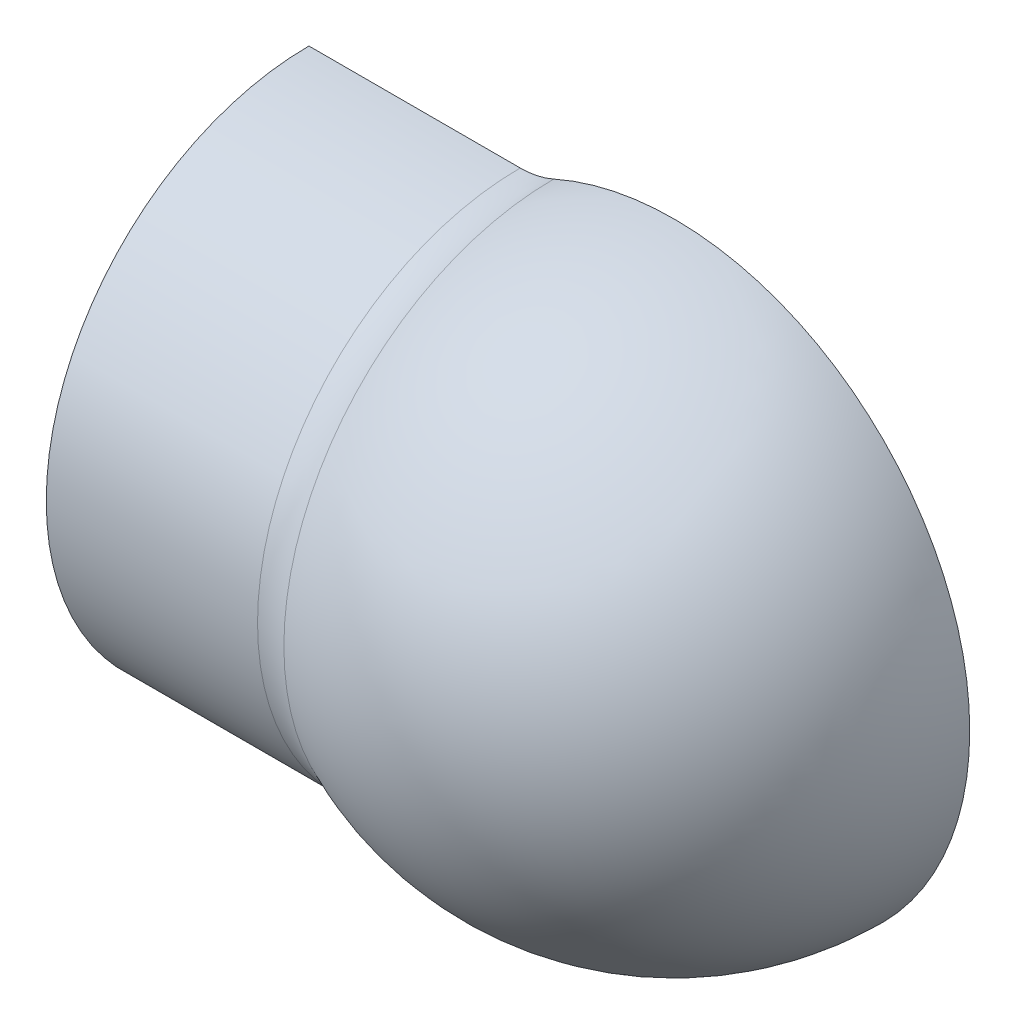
from build123d import *

# Parameters (mm, degrees)
R_VOLUTION1_ANGLE = 180
CONG_1_R          = 10
COQUE2_T          = -3


with BuildPart() as part:
    # Esquisse1 → R_volution1 (revolve)
    with BuildSketch(Plane.XY):
        with BuildLine():
            Line((-44.5, 0), (-44.5, 32))
            Line((-44.5, 32), (-16.492422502, 32))
            ThreePointArc((-16.492422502, 32), (18.738633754, 30.738633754), (36, 0))
            Line((36, 0), (-44.5, 0))
        make_face()
    revolve(axis=Axis((-44.5, 0, 0), (1, 0, 0)), revolution_arc=R_VOLUTION1_ANGLE)

    # Cong_1
    cong_1_edges = [part.edges().sort_by_distance(p)[0] for p in [
        (-16.492422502, 0, 32),
    ]]
    fillet(cong_1_edges, radius=CONG_1_R)

    # Coque2
    coque2_openings = [part.faces().sort_by_distance(p)[0] for p in [
        (-6.601147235, 0, 0),
    ]]
    offset(amount=COQUE2_T, openings=coque2_openings)


solid = part.part
